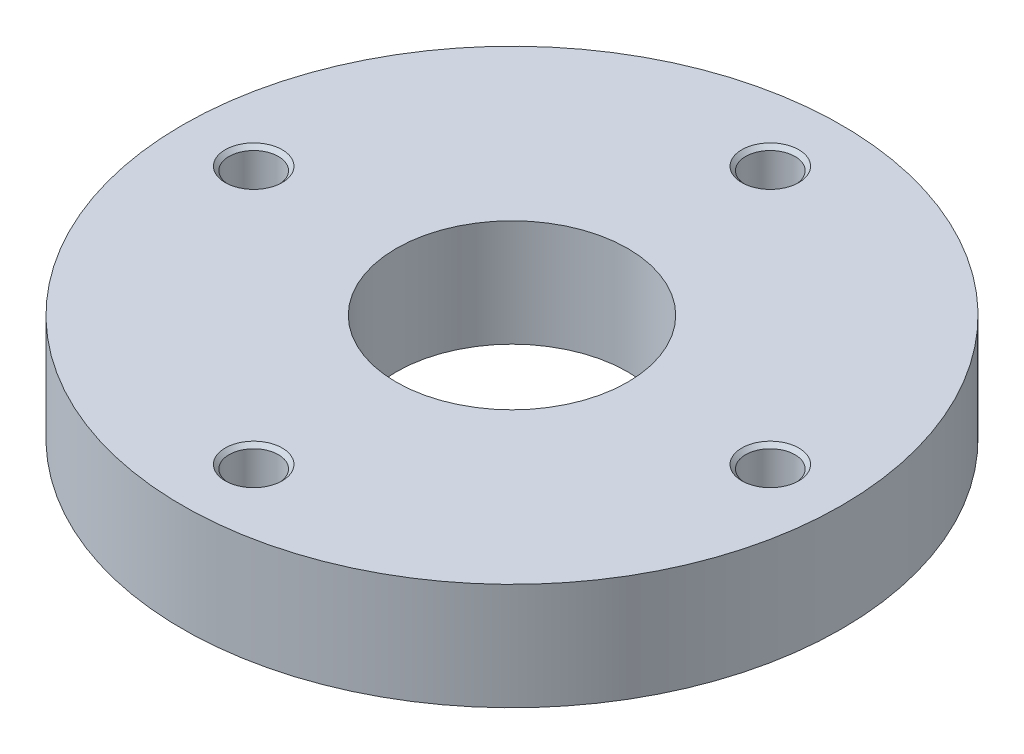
ISO-10303-21;
HEADER;
FILE_DESCRIPTION(('STEP AP214'),'2;1');
FILE_NAME('part.step','',(''),(''),'','','');
FILE_SCHEMA(('AUTOMOTIVE_DESIGN { 1 0 10303 214 1 1 1 1 }'));
ENDSEC;
DATA;
#1=APPLICATION_CONTEXT('core data for automotive mechanical design processes');
#2=APPLICATION_PROTOCOL_DEFINITION('international standard','automotive_design',2000,#1);
#3=PRODUCT_CONTEXT('',#1,'mechanical');
#4=PRODUCT('Part','Part','',(#3));
#5=PRODUCT_RELATED_PRODUCT_CATEGORY('part','',(#4));
#6=PRODUCT_DEFINITION_FORMATION('','',#4);
#7=PRODUCT_DEFINITION_CONTEXT('part definition',#1,'design');
#8=PRODUCT_DEFINITION('design','',#6,#7);
#9=PRODUCT_DEFINITION_SHAPE('','',#8);
#10=(LENGTH_UNIT() NAMED_UNIT(*) SI_UNIT(.MILLI.,.METRE.));
#11=(NAMED_UNIT(*) PLANE_ANGLE_UNIT() SI_UNIT($,.RADIAN.));
#12=(NAMED_UNIT(*) SI_UNIT($,.STERADIAN.) SOLID_ANGLE_UNIT());
#13=UNCERTAINTY_MEASURE_WITH_UNIT(LENGTH_MEASURE(1.E-05),#10,'distance_accuracy_value','');
#14=(GEOMETRIC_REPRESENTATION_CONTEXT(3) GLOBAL_UNCERTAINTY_ASSIGNED_CONTEXT((#13)) GLOBAL_UNIT_ASSIGNED_CONTEXT((#10,
#11,#12)) REPRESENTATION_CONTEXT('',''));
#15=CARTESIAN_POINT('',(0.,0.,0.));
#16=DIRECTION('',(0.,0.,1.));
#17=DIRECTION('',(1.,0.,0.));
#18=AXIS2_PLACEMENT_3D('',#15,#16,#17);
#19=CARTESIAN_POINT('',(0.,15.,0.));
#20=DIRECTION('',(0.,-1.,0.));
#21=DIRECTION('',(1.,0.,0.));
#22=AXIS2_PLACEMENT_3D('',#19,#20,#21);
#23=CYLINDRICAL_SURFACE('',#22,92.5);
#24=CARTESIAN_POINT('',(0.,0.,0.));
#25=DIRECTION('',(0.,1.,0.));
#26=DIRECTION('',(1.,0.,0.));
#27=AXIS2_PLACEMENT_3D('',#24,#25,#26);
#28=CIRCLE('',#27,92.5);
#29=CARTESIAN_POINT('',(92.5,0.,0.));
#30=VERTEX_POINT('',#29);
#31=EDGE_CURVE('E9',#30,#30,#28,.T.);
#32=ORIENTED_EDGE('',*,*,#31,.T.);
#33=EDGE_LOOP('',(#32));
#34=FACE_BOUND('',#33,.T.);
#35=CARTESIAN_POINT('',(0.,30.,0.));
#36=DIRECTION('',(0.,1.,0.));
#37=DIRECTION('',(1.,0.,0.));
#38=AXIS2_PLACEMENT_3D('',#35,#36,#37);
#39=CIRCLE('',#38,92.5);
#40=CARTESIAN_POINT('',(92.5,30.,0.));
#41=VERTEX_POINT('',#40);
#42=EDGE_CURVE('E149',#41,#41,#39,.T.);
#43=ORIENTED_EDGE('',*,*,#42,.F.);
#44=EDGE_LOOP('',(#43));
#45=FACE_BOUND('',#44,.T.);
#46=ADVANCED_FACE('F15',(#34,#45),#23,.T.);
#47=CARTESIAN_POINT('',(62.5,0.,0.));
#48=DIRECTION('',(0.,-1.,0.));
#49=DIRECTION('',(-1.,0.,0.));
#50=AXIS2_PLACEMENT_3D('',#47,#48,#49);
#51=PLANE('',#50);
#52=CARTESIAN_POINT('',(0.,0.,0.));
#53=DIRECTION('',(0.,1.,0.));
#54=DIRECTION('',(1.,0.,0.));
#55=AXIS2_PLACEMENT_3D('',#52,#53,#54);
#56=CIRCLE('',#55,32.5);
#57=CARTESIAN_POINT('',(32.5,0.,0.));
#58=VERTEX_POINT('',#57);
#59=EDGE_CURVE('E22',#58,#58,#56,.T.);
#60=ORIENTED_EDGE('',*,*,#59,.T.);
#61=EDGE_LOOP('',(#60));
#62=FACE_BOUND('',#61,.T.);
#63=ORIENTED_EDGE('',*,*,#31,.F.);
#64=EDGE_LOOP('',(#63));
#65=FACE_BOUND('',#64,.T.);
#66=ADVANCED_FACE('F142',(#62,#65),#51,.T.);
#67=CARTESIAN_POINT('',(0.,15.,0.));
#68=DIRECTION('',(0.,-1.,0.));
#69=DIRECTION('',(1.,0.,0.));
#70=AXIS2_PLACEMENT_3D('',#67,#68,#69);
#71=CYLINDRICAL_SURFACE('',#70,32.5);
#72=CARTESIAN_POINT('',(0.,30.,0.));
#73=DIRECTION('',(0.,1.,0.));
#74=DIRECTION('',(1.,0.,0.));
#75=AXIS2_PLACEMENT_3D('',#72,#73,#74);
#76=CIRCLE('',#75,32.5);
#77=CARTESIAN_POINT('',(32.5,30.,0.));
#78=VERTEX_POINT('',#77);
#79=EDGE_CURVE('E151',#78,#78,#76,.T.);
#80=ORIENTED_EDGE('',*,*,#79,.T.);
#81=EDGE_LOOP('',(#80));
#82=FACE_BOUND('',#81,.T.);
#83=ORIENTED_EDGE('',*,*,#59,.F.);
#84=EDGE_LOOP('',(#83));
#85=FACE_BOUND('',#84,.T.);
#86=ADVANCED_FACE('F146',(#82,#85),#71,.F.);
#87=CARTESIAN_POINT('',(62.5,30.,0.));
#88=DIRECTION('',(0.,1.,0.));
#89=DIRECTION('',(1.,0.,0.));
#90=AXIS2_PLACEMENT_3D('',#87,#88,#89);
#91=PLANE('',#90);
#92=ORIENTED_EDGE('',*,*,#42,.T.);
#93=EDGE_LOOP('',(#92));
#94=FACE_BOUND('',#93,.T.);
#95=ORIENTED_EDGE('',*,*,#79,.F.);
#96=EDGE_LOOP('',(#95));
#97=FACE_BOUND('',#96,.T.);
#98=CARTESIAN_POINT('',(72.5,30.,0.));
#99=DIRECTION('',(0.,-1.,0.));
#100=DIRECTION('',(1.,0.,0.));
#101=AXIS2_PLACEMENT_3D('',#98,#99,#100);
#102=CIRCLE('',#101,8.);
#103=CARTESIAN_POINT('',(80.5,30.,0.));
#104=VERTEX_POINT('',#103);
#105=EDGE_CURVE('E196',#104,#104,#102,.T.);
#106=ORIENTED_EDGE('',*,*,#105,.T.);
#107=EDGE_LOOP('',(#106));
#108=FACE_BOUND('',#107,.T.);
#109=CARTESIAN_POINT('',(0.,30.,-72.5));
#110=DIRECTION('',(0.,-1.,0.));
#111=DIRECTION('',(0.,0.,-1.));
#112=AXIS2_PLACEMENT_3D('',#109,#110,#111);
#113=CIRCLE('',#112,8.);
#114=CARTESIAN_POINT('',(0.,30.,-80.5));
#115=VERTEX_POINT('',#114);
#116=EDGE_CURVE('E169',#115,#115,#113,.T.);
#117=ORIENTED_EDGE('',*,*,#116,.T.);
#118=EDGE_LOOP('',(#117));
#119=FACE_BOUND('',#118,.T.);
#120=CARTESIAN_POINT('',(-72.5,30.,0.));
#121=DIRECTION('',(0.,-1.,0.));
#122=DIRECTION('',(-1.,0.,0.));
#123=AXIS2_PLACEMENT_3D('',#120,#121,#122);
#124=CIRCLE('',#123,8.);
#125=CARTESIAN_POINT('',(-80.5,30.,0.));
#126=VERTEX_POINT('',#125);
#127=EDGE_CURVE('E156',#126,#126,#124,.T.);
#128=ORIENTED_EDGE('',*,*,#127,.T.);
#129=EDGE_LOOP('',(#128));
#130=FACE_BOUND('',#129,.T.);
#131=CARTESIAN_POINT('',(0.,30.,72.5));
#132=DIRECTION('',(0.,-1.,0.));
#133=DIRECTION('',(0.,0.,1.));
#134=AXIS2_PLACEMENT_3D('',#131,#132,#133);
#135=CIRCLE('',#134,8.);
#136=CARTESIAN_POINT('',(0.,30.,80.5));
#137=VERTEX_POINT('',#136);
#138=EDGE_CURVE('E166',#137,#137,#135,.T.);
#139=ORIENTED_EDGE('',*,*,#138,.T.);
#140=EDGE_LOOP('',(#139));
#141=FACE_BOUND('',#140,.T.);
#142=ADVANCED_FACE('F210',(#94,#97,#108,#119,#130,#141),#91,.T.);
#143=CARTESIAN_POINT('',(72.5,5.00308975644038,0.));
#144=DIRECTION('',(0.,1.,0.));
#145=DIRECTION('',(1.,0.,0.));
#146=AXIS2_PLACEMENT_3D('',#143,#144,#145);
#147=CONICAL_SURFACE('',#146,3.45875,1.0471975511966);
#148=CARTESIAN_POINT('',(72.5,7.,0.));
#149=DIRECTION('',(0.,-1.,0.));
#150=DIRECTION('',(1.,0.,0.));
#151=AXIS2_PLACEMENT_3D('',#148,#149,#150);
#152=CIRCLE('',#151,6.9175);
#153=CARTESIAN_POINT('',(79.4175,7.,0.));
#154=VERTEX_POINT('',#153);
#155=EDGE_CURVE('E153',#154,#154,#152,.T.);
#156=ORIENTED_EDGE('',*,*,#155,.F.);
#157=EDGE_LOOP('',(#156));
#158=FACE_BOUND('',#157,.T.);
#159=CARTESIAN_POINT('',(72.5,3.00617951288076,0.));
#160=VERTEX_POINT('',#159);
#161=VERTEX_LOOP('',#160);
#162=FACE_BOUND('',#161,.T.);
#163=ADVANCED_FACE('F208',(#158,#162),#147,.F.);
#164=CARTESIAN_POINT('',(72.5,9.95875,0.));
#165=DIRECTION('',(0.,1.,0.));
#166=DIRECTION('',(1.,0.,0.));
#167=AXIS2_PLACEMENT_3D('',#164,#165,#166);
#168=CYLINDRICAL_SURFACE('',#167,6.9175);
#169=CARTESIAN_POINT('',(72.5,12.9175,0.));
#170=DIRECTION('',(0.,-1.,0.));
#171=DIRECTION('',(1.,0.,0.));
#172=AXIS2_PLACEMENT_3D('',#169,#170,#171);
#173=CIRCLE('',#172,6.9175);
#174=CARTESIAN_POINT('',(79.4175,12.9175,0.));
#175=VERTEX_POINT('',#174);
#176=EDGE_CURVE('E202',#175,#175,#173,.T.);
#177=ORIENTED_EDGE('',*,*,#176,.F.);
#178=EDGE_LOOP('',(#177));
#179=FACE_BOUND('',#178,.T.);
#180=ORIENTED_EDGE('',*,*,#155,.T.);
#181=EDGE_LOOP('',(#180));
#182=FACE_BOUND('',#181,.T.);
#183=ADVANCED_FACE('F206',(#179,#182),#168,.F.);
#184=CARTESIAN_POINT('',(72.5,13.45875,0.));
#185=DIRECTION('',(0.,1.,0.));
#186=DIRECTION('',(1.,0.,0.));
#187=AXIS2_PLACEMENT_3D('',#184,#185,#186);
#188=CONICAL_SURFACE('',#187,7.45875,0.785398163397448);
#189=CARTESIAN_POINT('',(72.5,14.,0.));
#190=DIRECTION('',(0.,-1.,0.));
#191=DIRECTION('',(1.,0.,0.));
#192=AXIS2_PLACEMENT_3D('',#189,#190,#191);
#193=CIRCLE('',#192,8.);
#194=CARTESIAN_POINT('',(80.5,14.,0.));
#195=VERTEX_POINT('',#194);
#196=EDGE_CURVE('E200',#195,#195,#193,.T.);
#197=ORIENTED_EDGE('',*,*,#196,.F.);
#198=EDGE_LOOP('',(#197));
#199=FACE_BOUND('',#198,.T.);
#200=ORIENTED_EDGE('',*,*,#176,.T.);
#201=EDGE_LOOP('',(#200));
#202=FACE_BOUND('',#201,.T.);
#203=ADVANCED_FACE('F216',(#199,#202),#188,.F.);
#204=CARTESIAN_POINT('',(79.95875,14.,0.));
#205=DIRECTION('',(0.,1.,0.));
#206=DIRECTION('',(-1.,0.,0.));
#207=AXIS2_PLACEMENT_3D('',#204,#205,#206);
#208=PLANE('',#207);
#209=CARTESIAN_POINT('',(72.5,14.,0.));
#210=DIRECTION('',(0.,-1.,0.));
#211=DIRECTION('',(1.,0.,0.));
#212=AXIS2_PLACEMENT_3D('',#209,#210,#211);
#213=CIRCLE('',#212,6.9175);
#214=CARTESIAN_POINT('',(79.4175,14.,0.));
#215=VERTEX_POINT('',#214);
#216=EDGE_CURVE('E198',#215,#215,#213,.T.);
#217=ORIENTED_EDGE('',*,*,#216,.F.);
#218=EDGE_LOOP('',(#217));
#219=FACE_BOUND('',#218,.T.);
#220=ORIENTED_EDGE('',*,*,#196,.T.);
#221=EDGE_LOOP('',(#220));
#222=FACE_BOUND('',#221,.T.);
#223=ADVANCED_FACE('F415',(#219,#222),#208,.F.);
#224=CARTESIAN_POINT('',(72.5,21.45875,0.));
#225=DIRECTION('',(0.,1.,0.));
#226=DIRECTION('',(1.,0.,0.));
#227=AXIS2_PLACEMENT_3D('',#224,#225,#226);
#228=CYLINDRICAL_SURFACE('',#227,6.9175);
#229=CARTESIAN_POINT('',(72.5,28.9175,0.));
#230=DIRECTION('',(0.,-1.,0.));
#231=DIRECTION('',(1.,0.,0.));
#232=AXIS2_PLACEMENT_3D('',#229,#230,#231);
#233=CIRCLE('',#232,6.9175);
#234=CARTESIAN_POINT('',(79.4175,28.9175,0.));
#235=VERTEX_POINT('',#234);
#236=EDGE_CURVE('E194',#235,#235,#233,.T.);
#237=ORIENTED_EDGE('',*,*,#236,.F.);
#238=EDGE_LOOP('',(#237));
#239=FACE_BOUND('',#238,.T.);
#240=ORIENTED_EDGE('',*,*,#216,.T.);
#241=EDGE_LOOP('',(#240));
#242=FACE_BOUND('',#241,.T.);
#243=ADVANCED_FACE('F406',(#239,#242),#228,.F.);
#244=CARTESIAN_POINT('',(72.5,29.45875,0.));
#245=DIRECTION('',(0.,1.,0.));
#246=DIRECTION('',(1.,0.,0.));
#247=AXIS2_PLACEMENT_3D('',#244,#245,#246);
#248=CONICAL_SURFACE('',#247,7.45875,0.785398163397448);
#249=ORIENTED_EDGE('',*,*,#105,.F.);
#250=EDGE_LOOP('',(#249));
#251=FACE_BOUND('',#250,.T.);
#252=ORIENTED_EDGE('',*,*,#236,.T.);
#253=EDGE_LOOP('',(#252));
#254=FACE_BOUND('',#253,.T.);
#255=ADVANCED_FACE('F397',(#251,#254),#248,.F.);
#256=CARTESIAN_POINT('',(0.,5.00308975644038,-72.5));
#257=DIRECTION('',(0.,1.,0.));
#258=DIRECTION('',(0.,0.,-1.));
#259=AXIS2_PLACEMENT_3D('',#256,#257,#258);
#260=CONICAL_SURFACE('',#259,3.45875,1.0471975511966);
#261=CARTESIAN_POINT('',(0.,7.,-72.5));
#262=DIRECTION('',(0.,-1.,0.));
#263=DIRECTION('',(0.,0.,-1.));
#264=AXIS2_PLACEMENT_3D('',#261,#262,#263);
#265=CIRCLE('',#264,6.9175);
#266=CARTESIAN_POINT('',(0.,7.,-79.4175));
#267=VERTEX_POINT('',#266);
#268=EDGE_CURVE('E192',#267,#267,#265,.T.);
#269=ORIENTED_EDGE('',*,*,#268,.F.);
#270=EDGE_LOOP('',(#269));
#271=FACE_BOUND('',#270,.T.);
#272=CARTESIAN_POINT('',(0.,3.00617951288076,-72.5));
#273=VERTEX_POINT('',#272);
#274=VERTEX_LOOP('',#273);
#275=FACE_BOUND('',#274,.T.);
#276=ADVANCED_FACE('F388',(#271,#275),#260,.F.);
#277=CARTESIAN_POINT('',(0.,9.95875,-72.5));
#278=DIRECTION('',(0.,1.,0.));
#279=DIRECTION('',(0.,0.,-1.));
#280=AXIS2_PLACEMENT_3D('',#277,#278,#279);
#281=CYLINDRICAL_SURFACE('',#280,6.9175);
#282=CARTESIAN_POINT('',(0.,12.9175,-72.5));
#283=DIRECTION('',(0.,-1.,0.));
#284=DIRECTION('',(0.,0.,-1.));
#285=AXIS2_PLACEMENT_3D('',#282,#283,#284);
#286=CIRCLE('',#285,6.9175);
#287=CARTESIAN_POINT('',(0.,12.9175,-79.4175));
#288=VERTEX_POINT('',#287);
#289=EDGE_CURVE('E190',#288,#288,#286,.T.);
#290=ORIENTED_EDGE('',*,*,#289,.F.);
#291=EDGE_LOOP('',(#290));
#292=FACE_BOUND('',#291,.T.);
#293=ORIENTED_EDGE('',*,*,#268,.T.);
#294=EDGE_LOOP('',(#293));
#295=FACE_BOUND('',#294,.T.);
#296=ADVANCED_FACE('F379',(#292,#295),#281,.F.);
#297=CARTESIAN_POINT('',(0.,13.45875,-72.5));
#298=DIRECTION('',(0.,1.,0.));
#299=DIRECTION('',(0.,0.,-1.));
#300=AXIS2_PLACEMENT_3D('',#297,#298,#299);
#301=CONICAL_SURFACE('',#300,7.45875,0.785398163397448);
#302=CARTESIAN_POINT('',(0.,14.,-72.5));
#303=DIRECTION('',(0.,-1.,0.));
#304=DIRECTION('',(0.,0.,-1.));
#305=AXIS2_PLACEMENT_3D('',#302,#303,#304);
#306=CIRCLE('',#305,8.);
#307=CARTESIAN_POINT('',(0.,14.,-80.5));
#308=VERTEX_POINT('',#307);
#309=EDGE_CURVE('E188',#308,#308,#306,.T.);
#310=ORIENTED_EDGE('',*,*,#309,.F.);
#311=EDGE_LOOP('',(#310));
#312=FACE_BOUND('',#311,.T.);
#313=ORIENTED_EDGE('',*,*,#289,.T.);
#314=EDGE_LOOP('',(#313));
#315=FACE_BOUND('',#314,.T.);
#316=ADVANCED_FACE('F370',(#312,#315),#301,.F.);
#317=CARTESIAN_POINT('',(0.,14.,-79.95875));
#318=DIRECTION('',(0.,1.,0.));
#319=DIRECTION('',(0.,0.,1.));
#320=AXIS2_PLACEMENT_3D('',#317,#318,#319);
#321=PLANE('',#320);
#322=CARTESIAN_POINT('',(0.,14.,-72.5));
#323=DIRECTION('',(0.,-1.,0.));
#324=DIRECTION('',(0.,0.,-1.));
#325=AXIS2_PLACEMENT_3D('',#322,#323,#324);
#326=CIRCLE('',#325,6.9175);
#327=CARTESIAN_POINT('',(0.,14.,-79.4175));
#328=VERTEX_POINT('',#327);
#329=EDGE_CURVE('E171',#328,#328,#326,.T.);
#330=ORIENTED_EDGE('',*,*,#329,.F.);
#331=EDGE_LOOP('',(#330));
#332=FACE_BOUND('',#331,.T.);
#333=ORIENTED_EDGE('',*,*,#309,.T.);
#334=EDGE_LOOP('',(#333));
#335=FACE_BOUND('',#334,.T.);
#336=ADVANCED_FACE('F361',(#332,#335),#321,.F.);
#337=CARTESIAN_POINT('',(0.,21.45875,-72.5));
#338=DIRECTION('',(0.,1.,0.));
#339=DIRECTION('',(0.,0.,-1.));
#340=AXIS2_PLACEMENT_3D('',#337,#338,#339);
#341=CYLINDRICAL_SURFACE('',#340,6.9175);
#342=CARTESIAN_POINT('',(0.,28.9175,-72.5));
#343=DIRECTION('',(0.,-1.,0.));
#344=DIRECTION('',(0.,0.,-1.));
#345=AXIS2_PLACEMENT_3D('',#342,#343,#344);
#346=CIRCLE('',#345,6.9175);
#347=CARTESIAN_POINT('',(0.,28.9175,-79.4175));
#348=VERTEX_POINT('',#347);
#349=EDGE_CURVE('E172',#348,#348,#346,.T.);
#350=ORIENTED_EDGE('',*,*,#349,.F.);
#351=EDGE_LOOP('',(#350));
#352=FACE_BOUND('',#351,.T.);
#353=ORIENTED_EDGE('',*,*,#329,.T.);
#354=EDGE_LOOP('',(#353));
#355=FACE_BOUND('',#354,.T.);
#356=ADVANCED_FACE('F353',(#352,#355),#341,.F.);
#357=CARTESIAN_POINT('',(0.,29.45875,-72.5));
#358=DIRECTION('',(0.,1.,0.));
#359=DIRECTION('',(0.,0.,-1.));
#360=AXIS2_PLACEMENT_3D('',#357,#358,#359);
#361=CONICAL_SURFACE('',#360,7.45875,0.785398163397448);
#362=ORIENTED_EDGE('',*,*,#116,.F.);
#363=EDGE_LOOP('',(#362));
#364=FACE_BOUND('',#363,.T.);
#365=ORIENTED_EDGE('',*,*,#349,.T.);
#366=EDGE_LOOP('',(#365));
#367=FACE_BOUND('',#366,.T.);
#368=ADVANCED_FACE('F257',(#364,#367),#361,.F.);
#369=CARTESIAN_POINT('',(-72.5,5.00308975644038,0.));
#370=DIRECTION('',(0.,1.,0.));
#371=DIRECTION('',(-1.,0.,0.));
#372=AXIS2_PLACEMENT_3D('',#369,#370,#371);
#373=CONICAL_SURFACE('',#372,3.45875,1.0471975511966);
#374=CARTESIAN_POINT('',(-72.5,7.,0.));
#375=DIRECTION('',(0.,-1.,0.));
#376=DIRECTION('',(-1.,0.,0.));
#377=AXIS2_PLACEMENT_3D('',#374,#375,#376);
#378=CIRCLE('',#377,6.9175);
#379=CARTESIAN_POINT('',(-79.4175,7.,0.));
#380=VERTEX_POINT('',#379);
#381=EDGE_CURVE('E173',#380,#380,#378,.T.);
#382=ORIENTED_EDGE('',*,*,#381,.F.);
#383=EDGE_LOOP('',(#382));
#384=FACE_BOUND('',#383,.T.);
#385=CARTESIAN_POINT('',(-72.5,3.00617951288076,0.));
#386=VERTEX_POINT('',#385);
#387=VERTEX_LOOP('',#386);
#388=FACE_BOUND('',#387,.T.);
#389=ADVANCED_FACE('F252',(#384,#388),#373,.F.);
#390=CARTESIAN_POINT('',(-72.5,9.95875,0.));
#391=DIRECTION('',(0.,1.,0.));
#392=DIRECTION('',(-1.,0.,0.));
#393=AXIS2_PLACEMENT_3D('',#390,#391,#392);
#394=CYLINDRICAL_SURFACE('',#393,6.9175);
#395=CARTESIAN_POINT('',(-72.5,12.9175,0.));
#396=DIRECTION('',(0.,-1.,0.));
#397=DIRECTION('',(-1.,0.,0.));
#398=AXIS2_PLACEMENT_3D('',#395,#396,#397);
#399=CIRCLE('',#398,6.9175);
#400=CARTESIAN_POINT('',(-79.4175,12.9175,0.));
#401=VERTEX_POINT('',#400);
#402=EDGE_CURVE('E175',#401,#401,#399,.T.);
#403=ORIENTED_EDGE('',*,*,#402,.F.);
#404=EDGE_LOOP('',(#403));
#405=FACE_BOUND('',#404,.T.);
#406=ORIENTED_EDGE('',*,*,#381,.T.);
#407=EDGE_LOOP('',(#406));
#408=FACE_BOUND('',#407,.T.);
#409=ADVANCED_FACE('F249',(#405,#408),#394,.F.);
#410=CARTESIAN_POINT('',(-72.5,13.45875,0.));
#411=DIRECTION('',(0.,1.,0.));
#412=DIRECTION('',(-1.,0.,0.));
#413=AXIS2_PLACEMENT_3D('',#410,#411,#412);
#414=CONICAL_SURFACE('',#413,7.45875,0.785398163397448);
#415=CARTESIAN_POINT('',(-72.5,14.,0.));
#416=DIRECTION('',(0.,-1.,0.));
#417=DIRECTION('',(-1.,0.,0.));
#418=AXIS2_PLACEMENT_3D('',#415,#416,#417);
#419=CIRCLE('',#418,8.);
#420=CARTESIAN_POINT('',(-80.5,14.,0.));
#421=VERTEX_POINT('',#420);
#422=EDGE_CURVE('E184',#421,#421,#419,.T.);
#423=ORIENTED_EDGE('',*,*,#422,.F.);
#424=EDGE_LOOP('',(#423));
#425=FACE_BOUND('',#424,.T.);
#426=ORIENTED_EDGE('',*,*,#402,.T.);
#427=EDGE_LOOP('',(#426));
#428=FACE_BOUND('',#427,.T.);
#429=ADVANCED_FACE('F251',(#425,#428),#414,.F.);
#430=CARTESIAN_POINT('',(-79.95875,14.,0.));
#431=DIRECTION('',(0.,1.,0.));
#432=DIRECTION('',(1.,0.,0.));
#433=AXIS2_PLACEMENT_3D('',#430,#431,#432);
#434=PLANE('',#433);
#435=CARTESIAN_POINT('',(-72.5,14.,0.));
#436=DIRECTION('',(0.,-1.,0.));
#437=DIRECTION('',(-1.,0.,0.));
#438=AXIS2_PLACEMENT_3D('',#435,#436,#437);
#439=CIRCLE('',#438,6.9175);
#440=CARTESIAN_POINT('',(-79.4175,14.,0.));
#441=VERTEX_POINT('',#440);
#442=EDGE_CURVE('E159',#441,#441,#439,.T.);
#443=ORIENTED_EDGE('',*,*,#442,.F.);
#444=EDGE_LOOP('',(#443));
#445=FACE_BOUND('',#444,.T.);
#446=ORIENTED_EDGE('',*,*,#422,.T.);
#447=EDGE_LOOP('',(#446));
#448=FACE_BOUND('',#447,.T.);
#449=ADVANCED_FACE('F318',(#445,#448),#434,.F.);
#450=CARTESIAN_POINT('',(-72.5,21.45875,0.));
#451=DIRECTION('',(0.,1.,0.));
#452=DIRECTION('',(-1.,0.,0.));
#453=AXIS2_PLACEMENT_3D('',#450,#451,#452);
#454=CYLINDRICAL_SURFACE('',#453,6.9175);
#455=CARTESIAN_POINT('',(-72.5,28.9175,0.));
#456=DIRECTION('',(0.,-1.,0.));
#457=DIRECTION('',(-1.,0.,0.));
#458=AXIS2_PLACEMENT_3D('',#455,#456,#457);
#459=CIRCLE('',#458,6.9175);
#460=CARTESIAN_POINT('',(-79.4175,28.9175,0.));
#461=VERTEX_POINT('',#460);
#462=EDGE_CURVE('E160',#461,#461,#459,.T.);
#463=ORIENTED_EDGE('',*,*,#462,.F.);
#464=EDGE_LOOP('',(#463));
#465=FACE_BOUND('',#464,.T.);
#466=ORIENTED_EDGE('',*,*,#442,.T.);
#467=EDGE_LOOP('',(#466));
#468=FACE_BOUND('',#467,.T.);
#469=ADVANCED_FACE('F135',(#465,#468),#454,.F.);
#470=CARTESIAN_POINT('',(-72.5,29.45875,0.));
#471=DIRECTION('',(0.,1.,0.));
#472=DIRECTION('',(-1.,0.,0.));
#473=AXIS2_PLACEMENT_3D('',#470,#471,#472);
#474=CONICAL_SURFACE('',#473,7.45875,0.785398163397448);
#475=ORIENTED_EDGE('',*,*,#127,.F.);
#476=EDGE_LOOP('',(#475));
#477=FACE_BOUND('',#476,.T.);
#478=ORIENTED_EDGE('',*,*,#462,.T.);
#479=EDGE_LOOP('',(#478));
#480=FACE_BOUND('',#479,.T.);
#481=ADVANCED_FACE('F124',(#477,#480),#474,.F.);
#482=CARTESIAN_POINT('',(0.,5.00308975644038,72.5));
#483=DIRECTION('',(0.,1.,0.));
#484=DIRECTION('',(0.,0.,1.));
#485=AXIS2_PLACEMENT_3D('',#482,#483,#484);
#486=CONICAL_SURFACE('',#485,3.45875,1.0471975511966);
#487=CARTESIAN_POINT('',(0.,7.,72.5));
#488=DIRECTION('',(0.,-1.,0.));
#489=DIRECTION('',(0.,0.,1.));
#490=AXIS2_PLACEMENT_3D('',#487,#488,#489);
#491=CIRCLE('',#490,6.9175);
#492=CARTESIAN_POINT('',(0.,7.,79.4175));
#493=VERTEX_POINT('',#492);
#494=EDGE_CURVE('E161',#493,#493,#491,.T.);
#495=ORIENTED_EDGE('',*,*,#494,.F.);
#496=EDGE_LOOP('',(#495));
#497=FACE_BOUND('',#496,.T.);
#498=CARTESIAN_POINT('',(0.,3.00617951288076,72.5));
#499=VERTEX_POINT('',#498);
#500=VERTEX_LOOP('',#499);
#501=FACE_BOUND('',#500,.T.);
#502=ADVANCED_FACE('F121',(#497,#501),#486,.F.);
#503=CARTESIAN_POINT('',(0.,9.95875,72.5));
#504=DIRECTION('',(0.,1.,0.));
#505=DIRECTION('',(0.,0.,1.));
#506=AXIS2_PLACEMENT_3D('',#503,#504,#505);
#507=CYLINDRICAL_SURFACE('',#506,6.9175);
#508=CARTESIAN_POINT('',(0.,12.9175,72.5));
#509=DIRECTION('',(0.,-1.,0.));
#510=DIRECTION('',(0.,0.,1.));
#511=AXIS2_PLACEMENT_3D('',#508,#509,#510);
#512=CIRCLE('',#511,6.9175);
#513=CARTESIAN_POINT('',(0.,12.9175,79.4175));
#514=VERTEX_POINT('',#513);
#515=EDGE_CURVE('E164',#514,#514,#512,.T.);
#516=ORIENTED_EDGE('',*,*,#515,.F.);
#517=EDGE_LOOP('',(#516));
#518=FACE_BOUND('',#517,.T.);
#519=ORIENTED_EDGE('',*,*,#494,.T.);
#520=EDGE_LOOP('',(#519));
#521=FACE_BOUND('',#520,.T.);
#522=ADVANCED_FACE('F123',(#518,#521),#507,.F.);
#523=CARTESIAN_POINT('',(0.,13.45875,72.5));
#524=DIRECTION('',(0.,1.,0.));
#525=DIRECTION('',(0.,0.,1.));
#526=AXIS2_PLACEMENT_3D('',#523,#524,#525);
#527=CONICAL_SURFACE('',#526,7.45875,0.785398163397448);
#528=CARTESIAN_POINT('',(0.,14.,72.5));
#529=DIRECTION('',(0.,-1.,0.));
#530=DIRECTION('',(0.,0.,1.));
#531=AXIS2_PLACEMENT_3D('',#528,#529,#530);
#532=CIRCLE('',#531,8.);
#533=CARTESIAN_POINT('',(0.,14.,80.5));
#534=VERTEX_POINT('',#533);
#535=EDGE_CURVE('E178',#534,#534,#532,.T.);
#536=ORIENTED_EDGE('',*,*,#535,.F.);
#537=EDGE_LOOP('',(#536));
#538=FACE_BOUND('',#537,.T.);
#539=ORIENTED_EDGE('',*,*,#515,.T.);
#540=EDGE_LOOP('',(#539));
#541=FACE_BOUND('',#540,.T.);
#542=ADVANCED_FACE('F132',(#538,#541),#527,.F.);
#543=CARTESIAN_POINT('',(0.,14.,79.95875));
#544=DIRECTION('',(0.,1.,0.));
#545=DIRECTION('',(0.,0.,-1.));
#546=AXIS2_PLACEMENT_3D('',#543,#544,#545);
#547=PLANE('',#546);
#548=CARTESIAN_POINT('',(0.,14.,72.5));
#549=DIRECTION('',(0.,-1.,0.));
#550=DIRECTION('',(0.,0.,1.));
#551=AXIS2_PLACEMENT_3D('',#548,#549,#550);
#552=CIRCLE('',#551,6.9175);
#553=CARTESIAN_POINT('',(0.,14.,79.4175));
#554=VERTEX_POINT('',#553);
#555=EDGE_CURVE('E168',#554,#554,#552,.T.);
#556=ORIENTED_EDGE('',*,*,#555,.F.);
#557=EDGE_LOOP('',(#556));
#558=FACE_BOUND('',#557,.T.);
#559=ORIENTED_EDGE('',*,*,#535,.T.);
#560=EDGE_LOOP('',(#559));
#561=FACE_BOUND('',#560,.T.);
#562=ADVANCED_FACE('F245',(#558,#561),#547,.F.);
#563=CARTESIAN_POINT('',(0.,21.45875,72.5));
#564=DIRECTION('',(0.,1.,0.));
#565=DIRECTION('',(0.,0.,1.));
#566=AXIS2_PLACEMENT_3D('',#563,#564,#565);
#567=CYLINDRICAL_SURFACE('',#566,6.9175);
#568=CARTESIAN_POINT('',(0.,28.9175,72.5));
#569=DIRECTION('',(0.,-1.,0.));
#570=DIRECTION('',(0.,0.,1.));
#571=AXIS2_PLACEMENT_3D('',#568,#569,#570);
#572=CIRCLE('',#571,6.9175);
#573=CARTESIAN_POINT('',(0.,28.9175,79.4175));
#574=VERTEX_POINT('',#573);
#575=EDGE_CURVE('E94',#574,#574,#572,.T.);
#576=ORIENTED_EDGE('',*,*,#575,.F.);
#577=EDGE_LOOP('',(#576));
#578=FACE_BOUND('',#577,.T.);
#579=ORIENTED_EDGE('',*,*,#555,.T.);
#580=EDGE_LOOP('',(#579));
#581=FACE_BOUND('',#580,.T.);
#582=ADVANCED_FACE('F240',(#578,#581),#567,.F.);
#583=CARTESIAN_POINT('',(0.,29.45875,72.5));
#584=DIRECTION('',(0.,1.,0.));
#585=DIRECTION('',(0.,0.,1.));
#586=AXIS2_PLACEMENT_3D('',#583,#584,#585);
#587=CONICAL_SURFACE('',#586,7.45875,0.785398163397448);
#588=ORIENTED_EDGE('',*,*,#138,.F.);
#589=EDGE_LOOP('',(#588));
#590=FACE_BOUND('',#589,.T.);
#591=ORIENTED_EDGE('',*,*,#575,.T.);
#592=EDGE_LOOP('',(#591));
#593=FACE_BOUND('',#592,.T.);
#594=ADVANCED_FACE('F238',(#590,#593),#587,.F.);
#595=CLOSED_SHELL('',(#46,#66,#86,#142,#163,#183,#203,#223,#243,#255,#276,#296,#316,#336,#356,
#368,#389,#409,#429,#449,#469,#481,#502,#522,#542,#562,#582,#594));
#596=MANIFOLD_SOLID_BREP('B1',#595);
#597=ADVANCED_BREP_SHAPE_REPRESENTATION('',(#18,#596),#14);
#598=SHAPE_DEFINITION_REPRESENTATION(#9,#597);
ENDSEC;
END-ISO-10303-21;
